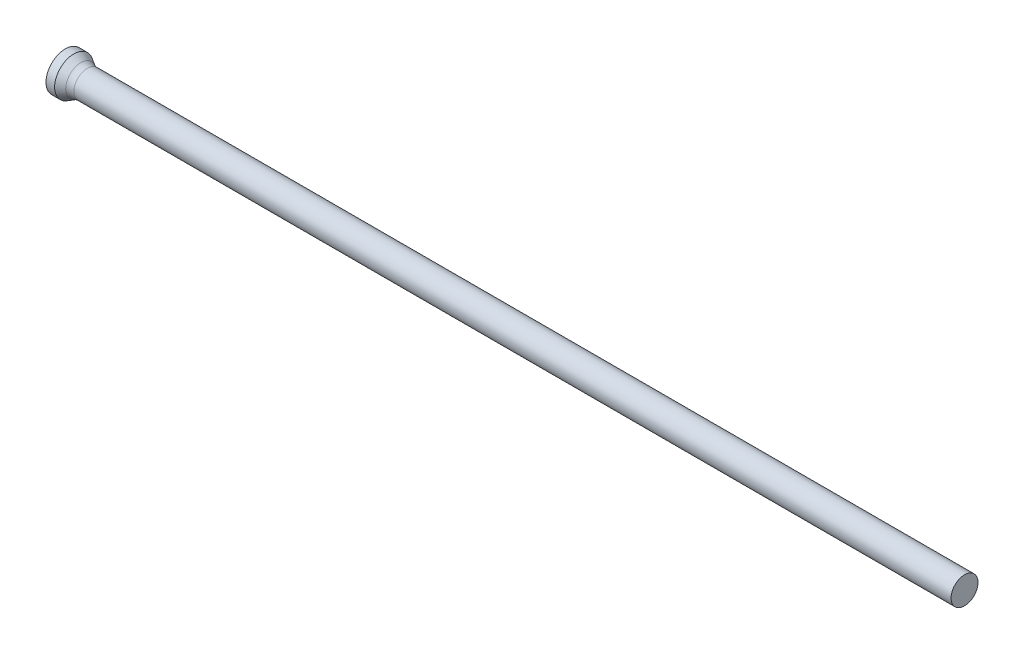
ISO-10303-21;
HEADER;
FILE_DESCRIPTION(('STEP AP214'),'2;1');
FILE_NAME('part.step','',(''),(''),'','','');
FILE_SCHEMA(('AUTOMOTIVE_DESIGN { 1 0 10303 214 1 1 1 1 }'));
ENDSEC;
DATA;
#1=APPLICATION_CONTEXT('core data for automotive mechanical design processes');
#2=APPLICATION_PROTOCOL_DEFINITION('international standard','automotive_design',2000,#1);
#3=PRODUCT_CONTEXT('',#1,'mechanical');
#4=PRODUCT('Part','Part','',(#3));
#5=PRODUCT_RELATED_PRODUCT_CATEGORY('part','',(#4));
#6=PRODUCT_DEFINITION_FORMATION('','',#4);
#7=PRODUCT_DEFINITION_CONTEXT('part definition',#1,'design');
#8=PRODUCT_DEFINITION('design','',#6,#7);
#9=PRODUCT_DEFINITION_SHAPE('','',#8);
#10=(LENGTH_UNIT() NAMED_UNIT(*) SI_UNIT(.MILLI.,.METRE.));
#11=(NAMED_UNIT(*) PLANE_ANGLE_UNIT() SI_UNIT($,.RADIAN.));
#12=(NAMED_UNIT(*) SI_UNIT($,.STERADIAN.) SOLID_ANGLE_UNIT());
#13=UNCERTAINTY_MEASURE_WITH_UNIT(LENGTH_MEASURE(1.E-05),#10,'distance_accuracy_value','');
#14=(GEOMETRIC_REPRESENTATION_CONTEXT(3) GLOBAL_UNCERTAINTY_ASSIGNED_CONTEXT((#13)) GLOBAL_UNIT_ASSIGNED_CONTEXT((#10,
#11,#12)) REPRESENTATION_CONTEXT('',''));
#15=CARTESIAN_POINT('',(0.,0.,0.));
#16=DIRECTION('',(0.,0.,1.));
#17=DIRECTION('',(1.,0.,0.));
#18=AXIS2_PLACEMENT_3D('',#15,#16,#17);
#19=CARTESIAN_POINT('',(0.,0.,0.));
#20=DIRECTION('',(1.,0.,0.));
#21=DIRECTION('',(0.,0.,-1.));
#22=AXIS2_PLACEMENT_3D('',#19,#20,#21);
#23=PLANE('',#22);
#24=CARTESIAN_POINT('',(0.,0.,0.));
#25=DIRECTION('',(-1.,0.,0.));
#26=DIRECTION('',(0.,0.,1.));
#27=AXIS2_PLACEMENT_3D('',#24,#25,#26);
#28=CIRCLE('',#27,1.5);
#29=CARTESIAN_POINT('',(0.,0.,1.5));
#30=VERTEX_POINT('',#29);
#31=EDGE_CURVE('E25',#30,#30,#28,.T.);
#32=ORIENTED_EDGE('',*,*,#31,.T.);
#33=EDGE_LOOP('',(#32));
#34=FACE_BOUND('',#33,.T.);
#35=ADVANCED_FACE('F14',(#34),#23,.F.);
#36=CARTESIAN_POINT('',(0.,0.,0.));
#37=DIRECTION('',(-1.,0.,0.));
#38=DIRECTION('',(0.,0.,1.));
#39=AXIS2_PLACEMENT_3D('',#36,#37,#38);
#40=CYLINDRICAL_SURFACE('',#39,1.5);
#41=ORIENTED_EDGE('',*,*,#31,.F.);
#42=EDGE_LOOP('',(#41));
#43=FACE_BOUND('',#42,.T.);
#44=CARTESIAN_POINT('',(0.670577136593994,0.,0.));
#45=DIRECTION('',(-1.,0.,0.));
#46=DIRECTION('',(0.,0.,1.));
#47=AXIS2_PLACEMENT_3D('',#44,#45,#46);
#48=CIRCLE('',#47,1.5);
#49=CARTESIAN_POINT('',(0.670577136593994,0.,1.5));
#50=VERTEX_POINT('',#49);
#51=EDGE_CURVE('E29',#50,#50,#48,.T.);
#52=ORIENTED_EDGE('',*,*,#51,.T.);
#53=EDGE_LOOP('',(#52));
#54=FACE_BOUND('',#53,.T.);
#55=ADVANCED_FACE('F53',(#43,#54),#40,.T.);
#56=CARTESIAN_POINT('',(1.45,0.,0.));
#57=DIRECTION('',(-1.,0.,0.));
#58=DIRECTION('',(0.,0.,1.));
#59=AXIS2_PLACEMENT_3D('',#56,#57,#58);
#60=CONICAL_SURFACE('',#59,1.05,0.523598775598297);
#61=CARTESIAN_POINT('',(1.21794919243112,0.,0.));
#62=DIRECTION('',(-1.,0.,0.));
#63=DIRECTION('',(0.,0.,1.));
#64=AXIS2_PLACEMENT_3D('',#61,#62,#63);
#65=CIRCLE('',#64,1.18397459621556);
#66=CARTESIAN_POINT('',(1.21794919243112,0.,1.18397459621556));
#67=VERTEX_POINT('',#66);
#68=EDGE_CURVE('E21',#67,#67,#65,.T.);
#69=ORIENTED_EDGE('',*,*,#68,.T.);
#70=EDGE_LOOP('',(#69));
#71=FACE_BOUND('',#70,.T.);
#72=ORIENTED_EDGE('',*,*,#51,.F.);
#73=EDGE_LOOP('',(#72));
#74=FACE_BOUND('',#73,.T.);
#75=ADVANCED_FACE('F50',(#71,#74),#60,.T.);
#76=CARTESIAN_POINT('',(0.,0.,0.));
#77=DIRECTION('',(-1.,0.,0.));
#78=DIRECTION('',(0.,0.,1.));
#79=AXIS2_PLACEMENT_3D('',#76,#77,#78);
#80=CYLINDRICAL_SURFACE('',#79,1.05);
#81=CARTESIAN_POINT('',(1.71794919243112,0.,0.));
#82=DIRECTION('',(-1.,0.,0.));
#83=DIRECTION('',(0.,0.,1.));
#84=AXIS2_PLACEMENT_3D('',#81,#82,#83);
#85=CIRCLE('',#84,1.05);
#86=CARTESIAN_POINT('',(1.71794919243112,0.,1.05));
#87=VERTEX_POINT('',#86);
#88=EDGE_CURVE('E9',#87,#87,#85,.F.);
#89=ORIENTED_EDGE('',*,*,#88,.T.);
#90=EDGE_LOOP('',(#89));
#91=FACE_BOUND('',#90,.T.);
#92=CARTESIAN_POINT('',(70.,0.,0.));
#93=DIRECTION('',(-1.,0.,0.));
#94=DIRECTION('',(0.,0.,1.));
#95=AXIS2_PLACEMENT_3D('',#92,#93,#94);
#96=CIRCLE('',#95,1.05);
#97=CARTESIAN_POINT('',(70.,0.,1.05));
#98=VERTEX_POINT('',#97);
#99=EDGE_CURVE('E34',#98,#98,#96,.T.);
#100=ORIENTED_EDGE('',*,*,#99,.T.);
#101=EDGE_LOOP('',(#100));
#102=FACE_BOUND('',#101,.T.);
#103=ADVANCED_FACE('F38',(#91,#102),#80,.T.);
#104=CARTESIAN_POINT('',(70.,1.05,0.));
#105=DIRECTION('',(-1.,0.,0.));
#106=DIRECTION('',(0.,0.,1.));
#107=AXIS2_PLACEMENT_3D('',#104,#105,#106);
#108=PLANE('',#107);
#109=ORIENTED_EDGE('',*,*,#99,.F.);
#110=EDGE_LOOP('',(#109));
#111=FACE_BOUND('',#110,.T.);
#112=ADVANCED_FACE('F40',(#111),#108,.F.);
#113=CARTESIAN_POINT('',(1.71794919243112,0.,0.));
#114=DIRECTION('',(-1.,0.,0.));
#115=DIRECTION('',(0.,0.,1.));
#116=AXIS2_PLACEMENT_3D('',#113,#114,#115);
#117=TOROIDAL_SURFACE('',#116,2.05,1.);
#118=ORIENTED_EDGE('',*,*,#88,.F.);
#119=EDGE_LOOP('',(#118));
#120=FACE_BOUND('',#119,.T.);
#121=ORIENTED_EDGE('',*,*,#68,.F.);
#122=EDGE_LOOP('',(#121));
#123=FACE_BOUND('',#122,.T.);
#124=ADVANCED_FACE('F16',(#120,#123),#117,.F.);
#125=CLOSED_SHELL('',(#35,#55,#75,#103,#112,#124));
#126=MANIFOLD_SOLID_BREP('B1',#125);
#127=ADVANCED_BREP_SHAPE_REPRESENTATION('',(#18,#126),#14);
#128=SHAPE_DEFINITION_REPRESENTATION(#9,#127);
ENDSEC;
END-ISO-10303-21;
